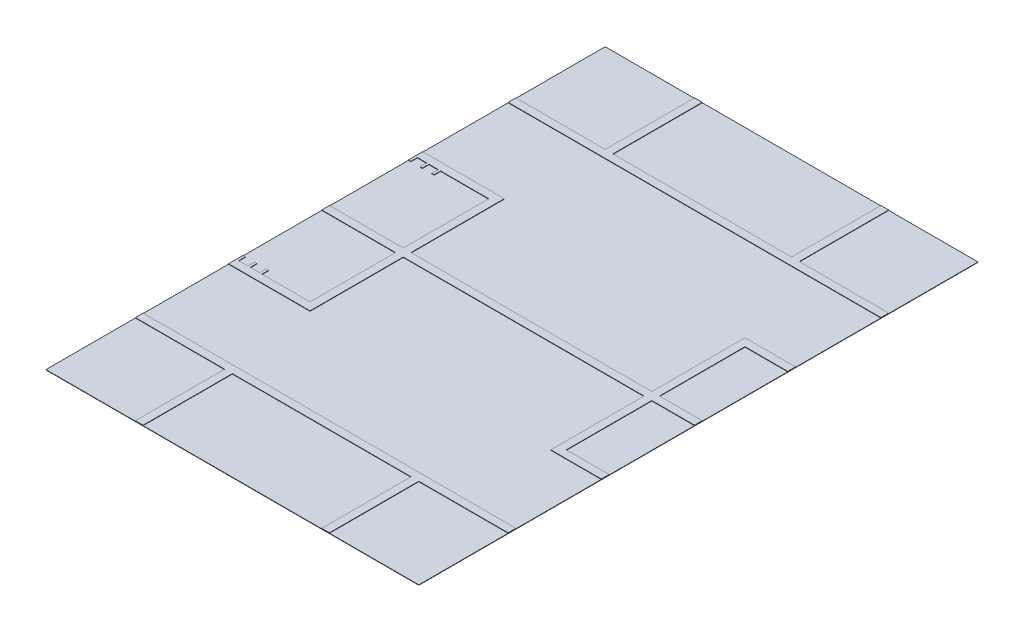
from build123d import *

# Parameters (mm, degrees)
SKETCH1_W           = 2438.4
SKETCH1_H           = 3657.6
BOSS_EXTRUDE1_DEPTH = 2.54
BOSS_EXTRUDE2_DEPTH = 2.54


with BuildPart() as part:
    # Sketch1 → Boss-Extrude1 (new body)
    with BuildSketch(Plane(origin=(0, 0, 0), x_dir=(1, 0, 0), z_dir=(0, 1, 0))):
        with Locations((1219.2, 1828.8)):
            Rectangle(SKETCH1_W, SKETCH1_H)
    extrude(amount=BOSS_EXTRUDE1_DEPTH)

    # Sketch2 → Boss-Extrude2 (add)
    with BuildSketch(Plane(origin=(0, 2.54, 0), x_dir=(1, 0, 0), z_dir=(0, 1, 0))):
        Polygon((0, 1854.2), (0, 1803.4), (482.6, 1803.4), (482.6, 1244.6), (168.275, 1244.6), (168.275, 1287.4625), (152.4, 1287.4625), (152.4, 1244.6), (92.075, 1244.6), (92.075, 1287.4625), (76.2, 1287.4625), (76.2, 1244.6), (15.875, 1244.6), (15.875, 1287.4625), (0, 1287.4625), (0, 1193.8), (533.4, 1193.8), (533.4, 1803.4), (2108.2, 1803.4), (2108.2, 1193.8), (2438.4, 1193.8), (2438.4, 1244.6), (2159, 1244.6), (2159, 1803.4), (2438.4, 1803.4), (2438.4, 1854.2), (2159, 1854.2), (2159, 2413), (2438.4, 2413), (2438.4, 2463.8), (2108.2, 2463.8), (2108.2, 1854.2), (533.4, 1854.2), (533.4, 2463.8), (0, 2463.8), (0, 2370.1375), (15.875, 2370.1375), (15.875, 2413), (76.2, 2413), (76.2, 2370.1375), (92.075, 2370.1375), (92.075, 2413), (152.4, 2413), (152.4, 2370.1375), (168.275, 2370.1375), (168.275, 2413), (482.6, 2413), (482.6, 1854.2), align=None)
        Polygon((2438.4, 635), (0, 635), (0, 584.2), (584.2, 584.2), (584.2, 0), (635, 0), (635, 584.2), (1803.4, 584.2), (1803.4, 0), (1854.2, 0), (1854.2, 584.2), (2438.4, 584.2), align=None)
        Polygon((0, 3073.4), (0, 3022.6), (2438.4, 3022.6), (2438.4, 3073.4), (1854.2, 3073.4), (1854.2, 3657.6), (1803.4, 3657.6), (1803.4, 3073.4), (635, 3073.4), (635, 3657.6), (584.2, 3657.6), (584.2, 3073.4), align=None)
    extrude(amount=BOSS_EXTRUDE2_DEPTH)


solid = part.part
